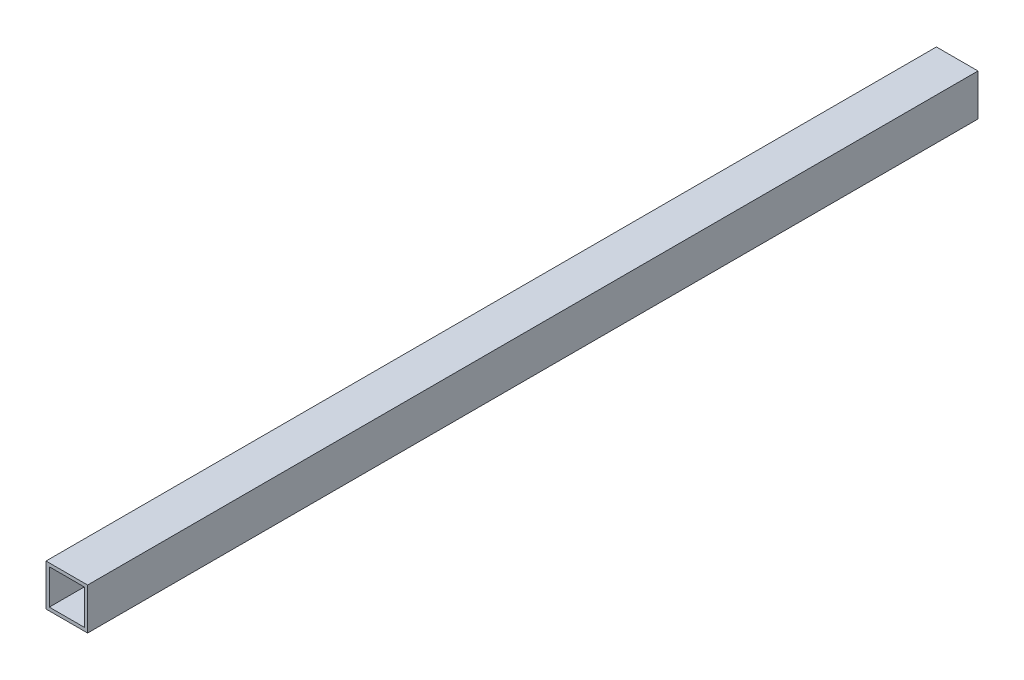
ISO-10303-21;
HEADER;
FILE_DESCRIPTION(('STEP AP214'),'2;1');
FILE_NAME('part.step','',(''),(''),'','','');
FILE_SCHEMA(('AUTOMOTIVE_DESIGN { 1 0 10303 214 1 1 1 1 }'));
ENDSEC;
DATA;
#1=APPLICATION_CONTEXT('core data for automotive mechanical design processes');
#2=APPLICATION_PROTOCOL_DEFINITION('international standard','automotive_design',2000,#1);
#3=PRODUCT_CONTEXT('',#1,'mechanical');
#4=PRODUCT('Part','Part','',(#3));
#5=PRODUCT_RELATED_PRODUCT_CATEGORY('part','',(#4));
#6=PRODUCT_DEFINITION_FORMATION('','',#4);
#7=PRODUCT_DEFINITION_CONTEXT('part definition',#1,'design');
#8=PRODUCT_DEFINITION('design','',#6,#7);
#9=PRODUCT_DEFINITION_SHAPE('','',#8);
#10=(LENGTH_UNIT() NAMED_UNIT(*) SI_UNIT(.MILLI.,.METRE.));
#11=(NAMED_UNIT(*) PLANE_ANGLE_UNIT() SI_UNIT($,.RADIAN.));
#12=(NAMED_UNIT(*) SI_UNIT($,.STERADIAN.) SOLID_ANGLE_UNIT());
#13=UNCERTAINTY_MEASURE_WITH_UNIT(LENGTH_MEASURE(1.E-05),#10,'distance_accuracy_value','');
#14=(GEOMETRIC_REPRESENTATION_CONTEXT(3) GLOBAL_UNCERTAINTY_ASSIGNED_CONTEXT((#13)) GLOBAL_UNIT_ASSIGNED_CONTEXT((#10,
#11,#12)) REPRESENTATION_CONTEXT('',''));
#15=CARTESIAN_POINT('',(0.,0.,0.));
#16=DIRECTION('',(0.,0.,1.));
#17=DIRECTION('',(1.,0.,0.));
#18=AXIS2_PLACEMENT_3D('',#15,#16,#17);
#19=CARTESIAN_POINT('',(0.,0.,1070.));
#20=DIRECTION('',(0.,0.,1.));
#21=DIRECTION('',(1.,0.,0.));
#22=AXIS2_PLACEMENT_3D('',#19,#20,#21);
#23=PLANE('',#22);
#24=DIRECTION('',(0.,-1.,0.));
#25=VECTOR('',#24,1.);
#26=CARTESIAN_POINT('',(-21.,21.,1070.));
#27=LINE('',#26,#25);
#28=CARTESIAN_POINT('',(-21.,21.,1070.));
#29=VERTEX_POINT('',#28);
#30=CARTESIAN_POINT('',(-21.,-21.,1070.));
#31=VERTEX_POINT('',#30);
#32=EDGE_CURVE('E19',#29,#31,#27,.T.);
#33=ORIENTED_EDGE('',*,*,#32,.F.);
#34=DIRECTION('',(-1.,0.,0.));
#35=VECTOR('',#34,1.);
#36=CARTESIAN_POINT('',(21.,21.,1070.));
#37=LINE('',#36,#35);
#38=CARTESIAN_POINT('',(21.,21.,1070.));
#39=VERTEX_POINT('',#38);
#40=EDGE_CURVE('E185',#39,#29,#37,.T.);
#41=ORIENTED_EDGE('',*,*,#40,.F.);
#42=DIRECTION('',(0.,1.,0.));
#43=VECTOR('',#42,1.);
#44=CARTESIAN_POINT('',(21.,-21.,1070.));
#45=LINE('',#44,#43);
#46=CARTESIAN_POINT('',(21.,-21.,1070.));
#47=VERTEX_POINT('',#46);
#48=EDGE_CURVE('E153',#47,#39,#45,.T.);
#49=ORIENTED_EDGE('',*,*,#48,.F.);
#50=DIRECTION('',(1.,0.,0.));
#51=VECTOR('',#50,1.);
#52=CARTESIAN_POINT('',(-21.,-21.,1070.));
#53=LINE('',#52,#51);
#54=EDGE_CURVE('E144',#31,#47,#53,.T.);
#55=ORIENTED_EDGE('',*,*,#54,.F.);
#56=EDGE_LOOP('',(#33,#41,#49,#55));
#57=FACE_BOUND('',#56,.T.);
#58=DIRECTION('',(1.,0.,0.));
#59=VECTOR('',#58,1.);
#60=CARTESIAN_POINT('',(-25.,-25.,1070.));
#61=LINE('',#60,#59);
#62=CARTESIAN_POINT('',(-25.,-25.,1070.));
#63=VERTEX_POINT('',#62);
#64=CARTESIAN_POINT('',(25.,-25.,1070.));
#65=VERTEX_POINT('',#64);
#66=EDGE_CURVE('E121',#63,#65,#61,.T.);
#67=ORIENTED_EDGE('',*,*,#66,.T.);
#68=DIRECTION('',(0.,1.,0.));
#69=VECTOR('',#68,1.);
#70=CARTESIAN_POINT('',(25.,-25.,1070.));
#71=LINE('',#70,#69);
#72=CARTESIAN_POINT('',(25.,25.,1070.));
#73=VERTEX_POINT('',#72);
#74=EDGE_CURVE('E148',#65,#73,#71,.T.);
#75=ORIENTED_EDGE('',*,*,#74,.T.);
#76=DIRECTION('',(-1.,0.,0.));
#77=VECTOR('',#76,1.);
#78=CARTESIAN_POINT('',(25.,25.,1070.));
#79=LINE('',#78,#77);
#80=CARTESIAN_POINT('',(-25.,25.,1070.));
#81=VERTEX_POINT('',#80);
#82=EDGE_CURVE('E113',#73,#81,#79,.T.);
#83=ORIENTED_EDGE('',*,*,#82,.T.);
#84=DIRECTION('',(0.,-1.,0.));
#85=VECTOR('',#84,1.);
#86=CARTESIAN_POINT('',(-25.,25.,1070.));
#87=LINE('',#86,#85);
#88=EDGE_CURVE('E112',#81,#63,#87,.T.);
#89=ORIENTED_EDGE('',*,*,#88,.T.);
#90=EDGE_LOOP('',(#67,#75,#83,#89));
#91=FACE_BOUND('',#90,.T.);
#92=ADVANCED_FACE('F16',(#57,#91),#23,.T.);
#93=CARTESIAN_POINT('',(0.,0.,0.));
#94=DIRECTION('',(0.,0.,1.));
#95=DIRECTION('',(1.,0.,0.));
#96=AXIS2_PLACEMENT_3D('',#93,#94,#95);
#97=PLANE('',#96);
#98=DIRECTION('',(1.,0.,0.));
#99=VECTOR('',#98,1.);
#100=CARTESIAN_POINT('',(-21.,-21.,0.));
#101=LINE('',#100,#99);
#102=CARTESIAN_POINT('',(-21.,-21.,0.));
#103=VERTEX_POINT('',#102);
#104=CARTESIAN_POINT('',(21.,-21.,0.));
#105=VERTEX_POINT('',#104);
#106=EDGE_CURVE('E149',#103,#105,#101,.T.);
#107=ORIENTED_EDGE('',*,*,#106,.T.);
#108=DIRECTION('',(0.,1.,0.));
#109=VECTOR('',#108,1.);
#110=CARTESIAN_POINT('',(21.,-21.,0.));
#111=LINE('',#110,#109);
#112=CARTESIAN_POINT('',(21.,21.,0.));
#113=VERTEX_POINT('',#112);
#114=EDGE_CURVE('E181',#105,#113,#111,.T.);
#115=ORIENTED_EDGE('',*,*,#114,.T.);
#116=DIRECTION('',(-1.,0.,0.));
#117=VECTOR('',#116,1.);
#118=CARTESIAN_POINT('',(21.,21.,0.));
#119=LINE('',#118,#117);
#120=CARTESIAN_POINT('',(-21.,21.,0.));
#121=VERTEX_POINT('',#120);
#122=EDGE_CURVE('E191',#113,#121,#119,.T.);
#123=ORIENTED_EDGE('',*,*,#122,.T.);
#124=DIRECTION('',(0.,-1.,0.));
#125=VECTOR('',#124,1.);
#126=CARTESIAN_POINT('',(-21.,21.,0.));
#127=LINE('',#126,#125);
#128=EDGE_CURVE('E10',#121,#103,#127,.T.);
#129=ORIENTED_EDGE('',*,*,#128,.T.);
#130=EDGE_LOOP('',(#107,#115,#123,#129));
#131=FACE_BOUND('',#130,.T.);
#132=DIRECTION('',(0.,-1.,0.));
#133=VECTOR('',#132,1.);
#134=CARTESIAN_POINT('',(-25.,25.,0.));
#135=LINE('',#134,#133);
#136=CARTESIAN_POINT('',(-25.,25.,0.));
#137=VERTEX_POINT('',#136);
#138=CARTESIAN_POINT('',(-25.,-25.,0.));
#139=VERTEX_POINT('',#138);
#140=EDGE_CURVE('E101',#137,#139,#135,.T.);
#141=ORIENTED_EDGE('',*,*,#140,.F.);
#142=DIRECTION('',(-1.,0.,0.));
#143=VECTOR('',#142,1.);
#144=CARTESIAN_POINT('',(25.,25.,0.));
#145=LINE('',#144,#143);
#146=CARTESIAN_POINT('',(25.,25.,0.));
#147=VERTEX_POINT('',#146);
#148=EDGE_CURVE('E158',#147,#137,#145,.T.);
#149=ORIENTED_EDGE('',*,*,#148,.F.);
#150=DIRECTION('',(0.,1.,0.));
#151=VECTOR('',#150,1.);
#152=CARTESIAN_POINT('',(25.,-25.,0.));
#153=LINE('',#152,#151);
#154=CARTESIAN_POINT('',(25.,-25.,0.));
#155=VERTEX_POINT('',#154);
#156=EDGE_CURVE('E123',#155,#147,#153,.T.);
#157=ORIENTED_EDGE('',*,*,#156,.F.);
#158=DIRECTION('',(1.,0.,0.));
#159=VECTOR('',#158,1.);
#160=CARTESIAN_POINT('',(-25.,-25.,0.));
#161=LINE('',#160,#159);
#162=EDGE_CURVE('E119',#139,#155,#161,.T.);
#163=ORIENTED_EDGE('',*,*,#162,.F.);
#164=EDGE_LOOP('',(#141,#149,#157,#163));
#165=FACE_BOUND('',#164,.T.);
#166=ADVANCED_FACE('F125',(#131,#165),#97,.F.);
#167=CARTESIAN_POINT('',(-21.,21.,0.));
#168=DIRECTION('',(1.,0.,0.));
#169=DIRECTION('',(0.,1.,0.));
#170=AXIS2_PLACEMENT_3D('',#167,#168,#169);
#171=PLANE('',#170);
#172=DIRECTION('',(0.,0.,1.));
#173=VECTOR('',#172,1.);
#174=CARTESIAN_POINT('',(-21.,21.,0.));
#175=LINE('',#174,#173);
#176=EDGE_CURVE('E189',#121,#29,#175,.T.);
#177=ORIENTED_EDGE('',*,*,#176,.T.);
#178=ORIENTED_EDGE('',*,*,#32,.T.);
#179=DIRECTION('',(0.,0.,1.));
#180=VECTOR('',#179,1.);
#181=CARTESIAN_POINT('',(-21.,-21.,0.));
#182=LINE('',#181,#180);
#183=EDGE_CURVE('E140',#103,#31,#182,.T.);
#184=ORIENTED_EDGE('',*,*,#183,.F.);
#185=ORIENTED_EDGE('',*,*,#128,.F.);
#186=EDGE_LOOP('',(#177,#178,#184,#185));
#187=FACE_BOUND('',#186,.T.);
#188=ADVANCED_FACE('F199',(#187),#171,.T.);
#189=CARTESIAN_POINT('',(21.,21.,0.));
#190=DIRECTION('',(0.,-1.,0.));
#191=DIRECTION('',(0.,0.,-1.));
#192=AXIS2_PLACEMENT_3D('',#189,#190,#191);
#193=PLANE('',#192);
#194=DIRECTION('',(0.,0.,1.));
#195=VECTOR('',#194,1.);
#196=CARTESIAN_POINT('',(21.,21.,0.));
#197=LINE('',#196,#195);
#198=EDGE_CURVE('E177',#113,#39,#197,.T.);
#199=ORIENTED_EDGE('',*,*,#198,.T.);
#200=ORIENTED_EDGE('',*,*,#40,.T.);
#201=ORIENTED_EDGE('',*,*,#176,.F.);
#202=ORIENTED_EDGE('',*,*,#122,.F.);
#203=EDGE_LOOP('',(#199,#200,#201,#202));
#204=FACE_BOUND('',#203,.T.);
#205=ADVANCED_FACE('F209',(#204),#193,.T.);
#206=CARTESIAN_POINT('',(21.,-21.,0.));
#207=DIRECTION('',(-1.,0.,0.));
#208=DIRECTION('',(0.,0.,1.));
#209=AXIS2_PLACEMENT_3D('',#206,#207,#208);
#210=PLANE('',#209);
#211=DIRECTION('',(0.,0.,1.));
#212=VECTOR('',#211,1.);
#213=CARTESIAN_POINT('',(21.,-21.,0.));
#214=LINE('',#213,#212);
#215=EDGE_CURVE('E154',#105,#47,#214,.T.);
#216=ORIENTED_EDGE('',*,*,#215,.T.);
#217=ORIENTED_EDGE('',*,*,#48,.T.);
#218=ORIENTED_EDGE('',*,*,#198,.F.);
#219=ORIENTED_EDGE('',*,*,#114,.F.);
#220=EDGE_LOOP('',(#216,#217,#218,#219));
#221=FACE_BOUND('',#220,.T.);
#222=ADVANCED_FACE('F207',(#221),#210,.T.);
#223=CARTESIAN_POINT('',(-21.,-21.,0.));
#224=DIRECTION('',(0.,1.,0.));
#225=DIRECTION('',(1.,0.,0.));
#226=AXIS2_PLACEMENT_3D('',#223,#224,#225);
#227=PLANE('',#226);
#228=ORIENTED_EDGE('',*,*,#183,.T.);
#229=ORIENTED_EDGE('',*,*,#54,.T.);
#230=ORIENTED_EDGE('',*,*,#215,.F.);
#231=ORIENTED_EDGE('',*,*,#106,.F.);
#232=EDGE_LOOP('',(#228,#229,#230,#231));
#233=FACE_BOUND('',#232,.T.);
#234=ADVANCED_FACE('F204',(#233),#227,.T.);
#235=CARTESIAN_POINT('',(-25.,25.,0.));
#236=DIRECTION('',(1.,0.,0.));
#237=DIRECTION('',(0.,1.,0.));
#238=AXIS2_PLACEMENT_3D('',#235,#236,#237);
#239=PLANE('',#238);
#240=ORIENTED_EDGE('',*,*,#140,.T.);
#241=DIRECTION('',(0.,0.,1.));
#242=VECTOR('',#241,1.);
#243=CARTESIAN_POINT('',(-25.,-25.,0.));
#244=LINE('',#243,#242);
#245=EDGE_CURVE('E104',#139,#63,#244,.T.);
#246=ORIENTED_EDGE('',*,*,#245,.T.);
#247=ORIENTED_EDGE('',*,*,#88,.F.);
#248=DIRECTION('',(0.,0.,1.));
#249=VECTOR('',#248,1.);
#250=CARTESIAN_POINT('',(-25.,25.,0.));
#251=LINE('',#250,#249);
#252=EDGE_CURVE('E107',#137,#81,#251,.T.);
#253=ORIENTED_EDGE('',*,*,#252,.F.);
#254=EDGE_LOOP('',(#240,#246,#247,#253));
#255=FACE_BOUND('',#254,.T.);
#256=ADVANCED_FACE('F103',(#255),#239,.F.);
#257=CARTESIAN_POINT('',(25.,25.,0.));
#258=DIRECTION('',(0.,-1.,0.));
#259=DIRECTION('',(0.,0.,-1.));
#260=AXIS2_PLACEMENT_3D('',#257,#258,#259);
#261=PLANE('',#260);
#262=ORIENTED_EDGE('',*,*,#148,.T.);
#263=ORIENTED_EDGE('',*,*,#252,.T.);
#264=ORIENTED_EDGE('',*,*,#82,.F.);
#265=DIRECTION('',(0.,0.,1.));
#266=VECTOR('',#265,1.);
#267=CARTESIAN_POINT('',(25.,25.,0.));
#268=LINE('',#267,#266);
#269=EDGE_CURVE('E139',#147,#73,#268,.T.);
#270=ORIENTED_EDGE('',*,*,#269,.F.);
#271=EDGE_LOOP('',(#262,#263,#264,#270));
#272=FACE_BOUND('',#271,.T.);
#273=ADVANCED_FACE('F263',(#272),#261,.F.);
#274=CARTESIAN_POINT('',(25.,-25.,0.));
#275=DIRECTION('',(-1.,0.,0.));
#276=DIRECTION('',(0.,0.,1.));
#277=AXIS2_PLACEMENT_3D('',#274,#275,#276);
#278=PLANE('',#277);
#279=ORIENTED_EDGE('',*,*,#156,.T.);
#280=ORIENTED_EDGE('',*,*,#269,.T.);
#281=ORIENTED_EDGE('',*,*,#74,.F.);
#282=DIRECTION('',(0.,0.,1.));
#283=VECTOR('',#282,1.);
#284=CARTESIAN_POINT('',(25.,-25.,0.));
#285=LINE('',#284,#283);
#286=EDGE_CURVE('E129',#155,#65,#285,.T.);
#287=ORIENTED_EDGE('',*,*,#286,.F.);
#288=EDGE_LOOP('',(#279,#280,#281,#287));
#289=FACE_BOUND('',#288,.T.);
#290=ADVANCED_FACE('F272',(#289),#278,.F.);
#291=CARTESIAN_POINT('',(-25.,-25.,0.));
#292=DIRECTION('',(0.,1.,0.));
#293=DIRECTION('',(1.,0.,0.));
#294=AXIS2_PLACEMENT_3D('',#291,#292,#293);
#295=PLANE('',#294);
#296=ORIENTED_EDGE('',*,*,#162,.T.);
#297=ORIENTED_EDGE('',*,*,#286,.T.);
#298=ORIENTED_EDGE('',*,*,#66,.F.);
#299=ORIENTED_EDGE('',*,*,#245,.F.);
#300=EDGE_LOOP('',(#296,#297,#298,#299));
#301=FACE_BOUND('',#300,.T.);
#302=ADVANCED_FACE('F117',(#301),#295,.F.);
#303=CLOSED_SHELL('',(#92,#166,#188,#205,#222,#234,#256,#273,#290,#302));
#304=MANIFOLD_SOLID_BREP('B1',#303);
#305=ADVANCED_BREP_SHAPE_REPRESENTATION('',(#18,#304),#14);
#306=SHAPE_DEFINITION_REPRESENTATION(#9,#305);
ENDSEC;
END-ISO-10303-21;
